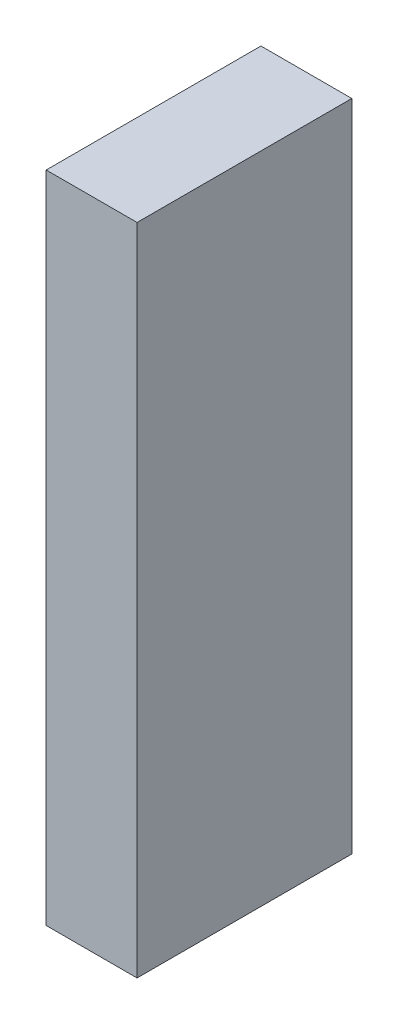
ISO-10303-21;
HEADER;
FILE_DESCRIPTION(('STEP AP214'),'2;1');
FILE_NAME('part.step','',(''),(''),'','','');
FILE_SCHEMA(('AUTOMOTIVE_DESIGN { 1 0 10303 214 1 1 1 1 }'));
ENDSEC;
DATA;
#1=APPLICATION_CONTEXT('core data for automotive mechanical design processes');
#2=APPLICATION_PROTOCOL_DEFINITION('international standard','automotive_design',2000,#1);
#3=PRODUCT_CONTEXT('',#1,'mechanical');
#4=PRODUCT('Part','Part','',(#3));
#5=PRODUCT_RELATED_PRODUCT_CATEGORY('part','',(#4));
#6=PRODUCT_DEFINITION_FORMATION('','',#4);
#7=PRODUCT_DEFINITION_CONTEXT('part definition',#1,'design');
#8=PRODUCT_DEFINITION('design','',#6,#7);
#9=PRODUCT_DEFINITION_SHAPE('','',#8);
#10=(LENGTH_UNIT() NAMED_UNIT(*) SI_UNIT(.MILLI.,.METRE.));
#11=(NAMED_UNIT(*) PLANE_ANGLE_UNIT() SI_UNIT($,.RADIAN.));
#12=(NAMED_UNIT(*) SI_UNIT($,.STERADIAN.) SOLID_ANGLE_UNIT());
#13=UNCERTAINTY_MEASURE_WITH_UNIT(LENGTH_MEASURE(1.E-05),#10,'distance_accuracy_value','');
#14=(GEOMETRIC_REPRESENTATION_CONTEXT(3) GLOBAL_UNCERTAINTY_ASSIGNED_CONTEXT((#13)) GLOBAL_UNIT_ASSIGNED_CONTEXT((#10,
#11,#12)) REPRESENTATION_CONTEXT('',''));
#15=CARTESIAN_POINT('',(0.,0.,0.));
#16=DIRECTION('',(0.,0.,1.));
#17=DIRECTION('',(1.,0.,0.));
#18=AXIS2_PLACEMENT_3D('',#15,#16,#17);
#19=CARTESIAN_POINT('',(127.,1828.8,-300.1));
#20=DIRECTION('',(-1.,0.,0.));
#21=DIRECTION('',(0.,0.,1.));
#22=AXIS2_PLACEMENT_3D('',#19,#20,#21);
#23=PLANE('',#22);
#24=DIRECTION('',(0.,0.,-1.));
#25=VECTOR('',#24,1.);
#26=CARTESIAN_POINT('',(127.,0.,-300.1));
#27=LINE('',#26,#25);
#28=CARTESIAN_POINT('',(127.,0.,300.1));
#29=VERTEX_POINT('',#28);
#30=CARTESIAN_POINT('',(127.,0.,-300.1));
#31=VERTEX_POINT('',#30);
#32=EDGE_CURVE('E96',#29,#31,#27,.T.);
#33=ORIENTED_EDGE('',*,*,#32,.T.);
#34=DIRECTION('',(0.,-1.,0.));
#35=VECTOR('',#34,1.);
#36=CARTESIAN_POINT('',(127.,1828.8,-300.1));
#37=LINE('',#36,#35);
#38=CARTESIAN_POINT('',(127.,1828.8,-300.1));
#39=VERTEX_POINT('',#38);
#40=EDGE_CURVE('E11',#39,#31,#37,.T.);
#41=ORIENTED_EDGE('',*,*,#40,.F.);
#42=DIRECTION('',(0.,0.,-1.));
#43=VECTOR('',#42,1.);
#44=CARTESIAN_POINT('',(127.,1828.8,-300.1));
#45=LINE('',#44,#43);
#46=CARTESIAN_POINT('',(127.,1828.8,300.1));
#47=VERTEX_POINT('',#46);
#48=EDGE_CURVE('E84',#47,#39,#45,.T.);
#49=ORIENTED_EDGE('',*,*,#48,.F.);
#50=DIRECTION('',(0.,-1.,0.));
#51=VECTOR('',#50,1.);
#52=CARTESIAN_POINT('',(127.,1828.8,300.1));
#53=LINE('',#52,#51);
#54=EDGE_CURVE('E92',#47,#29,#53,.T.);
#55=ORIENTED_EDGE('',*,*,#54,.T.);
#56=EDGE_LOOP('',(#33,#41,#49,#55));
#57=FACE_BOUND('',#56,.T.);
#58=ADVANCED_FACE('F33',(#57),#23,.F.);
#59=CARTESIAN_POINT('',(-127.,1828.8,-300.1));
#60=DIRECTION('',(0.,0.,1.));
#61=DIRECTION('',(1.,0.,0.));
#62=AXIS2_PLACEMENT_3D('',#59,#60,#61);
#63=PLANE('',#62);
#64=DIRECTION('',(-1.,0.,0.));
#65=VECTOR('',#64,1.);
#66=CARTESIAN_POINT('',(-127.,0.,-300.1));
#67=LINE('',#66,#65);
#68=CARTESIAN_POINT('',(-127.,0.,-300.1));
#69=VERTEX_POINT('',#68);
#70=EDGE_CURVE('E88',#31,#69,#67,.T.);
#71=ORIENTED_EDGE('',*,*,#70,.T.);
#72=DIRECTION('',(0.,-1.,0.));
#73=VECTOR('',#72,1.);
#74=CARTESIAN_POINT('',(-127.,1828.8,-300.1));
#75=LINE('',#74,#73);
#76=CARTESIAN_POINT('',(-127.,1828.8,-300.1));
#77=VERTEX_POINT('',#76);
#78=EDGE_CURVE('E41',#77,#69,#75,.T.);
#79=ORIENTED_EDGE('',*,*,#78,.F.);
#80=DIRECTION('',(-1.,0.,0.));
#81=VECTOR('',#80,1.);
#82=CARTESIAN_POINT('',(-127.,1828.8,-300.1));
#83=LINE('',#82,#81);
#84=EDGE_CURVE('E79',#39,#77,#83,.T.);
#85=ORIENTED_EDGE('',*,*,#84,.F.);
#86=ORIENTED_EDGE('',*,*,#40,.T.);
#87=EDGE_LOOP('',(#71,#79,#85,#86));
#88=FACE_BOUND('',#87,.T.);
#89=ADVANCED_FACE('F87',(#88),#63,.F.);
#90=CARTESIAN_POINT('',(-127.,1828.8,-300.1));
#91=DIRECTION('',(1.,0.,0.));
#92=DIRECTION('',(0.,0.,-1.));
#93=AXIS2_PLACEMENT_3D('',#90,#91,#92);
#94=PLANE('',#93);
#95=DIRECTION('',(0.,0.,1.));
#96=VECTOR('',#95,1.);
#97=CARTESIAN_POINT('',(-127.,0.,-300.1));
#98=LINE('',#97,#96);
#99=CARTESIAN_POINT('',(-127.,0.,300.1));
#100=VERTEX_POINT('',#99);
#101=EDGE_CURVE('E66',#69,#100,#98,.T.);
#102=ORIENTED_EDGE('',*,*,#101,.T.);
#103=DIRECTION('',(0.,-1.,0.));
#104=VECTOR('',#103,1.);
#105=CARTESIAN_POINT('',(-127.,1828.8,300.1));
#106=LINE('',#105,#104);
#107=CARTESIAN_POINT('',(-127.,1828.8,300.1));
#108=VERTEX_POINT('',#107);
#109=EDGE_CURVE('E89',#108,#100,#106,.T.);
#110=ORIENTED_EDGE('',*,*,#109,.F.);
#111=DIRECTION('',(0.,0.,1.));
#112=VECTOR('',#111,1.);
#113=CARTESIAN_POINT('',(-127.,1828.8,-300.1));
#114=LINE('',#113,#112);
#115=EDGE_CURVE('E82',#77,#108,#114,.T.);
#116=ORIENTED_EDGE('',*,*,#115,.F.);
#117=ORIENTED_EDGE('',*,*,#78,.T.);
#118=EDGE_LOOP('',(#102,#110,#116,#117));
#119=FACE_BOUND('',#118,.T.);
#120=ADVANCED_FACE('F90',(#119),#94,.F.);
#121=CARTESIAN_POINT('',(-127.,1828.8,300.1));
#122=DIRECTION('',(0.,0.,-1.));
#123=DIRECTION('',(-1.,0.,0.));
#124=AXIS2_PLACEMENT_3D('',#121,#122,#123);
#125=PLANE('',#124);
#126=DIRECTION('',(1.,0.,0.));
#127=VECTOR('',#126,1.);
#128=CARTESIAN_POINT('',(-127.,0.,300.1));
#129=LINE('',#128,#127);
#130=EDGE_CURVE('E72',#100,#29,#129,.T.);
#131=ORIENTED_EDGE('',*,*,#130,.T.);
#132=ORIENTED_EDGE('',*,*,#54,.F.);
#133=DIRECTION('',(1.,0.,0.));
#134=VECTOR('',#133,1.);
#135=CARTESIAN_POINT('',(-127.,1828.8,300.1));
#136=LINE('',#135,#134);
#137=EDGE_CURVE('E49',#108,#47,#136,.T.);
#138=ORIENTED_EDGE('',*,*,#137,.F.);
#139=ORIENTED_EDGE('',*,*,#109,.T.);
#140=EDGE_LOOP('',(#131,#132,#138,#139));
#141=FACE_BOUND('',#140,.T.);
#142=ADVANCED_FACE('F103',(#141),#125,.F.);
#143=CARTESIAN_POINT('',(0.,1828.8,0.));
#144=DIRECTION('',(0.,1.,0.));
#145=DIRECTION('',(0.,0.,1.));
#146=AXIS2_PLACEMENT_3D('',#143,#144,#145);
#147=PLANE('',#146);
#148=ORIENTED_EDGE('',*,*,#48,.T.);
#149=ORIENTED_EDGE('',*,*,#84,.T.);
#150=ORIENTED_EDGE('',*,*,#115,.T.);
#151=ORIENTED_EDGE('',*,*,#137,.T.);
#152=EDGE_LOOP('',(#148,#149,#150,#151));
#153=FACE_BOUND('',#152,.T.);
#154=ADVANCED_FACE('F80',(#153),#147,.T.);
#155=CARTESIAN_POINT('',(0.,0.,0.));
#156=DIRECTION('',(0.,1.,0.));
#157=DIRECTION('',(0.,0.,1.));
#158=AXIS2_PLACEMENT_3D('',#155,#156,#157);
#159=PLANE('',#158);
#160=ORIENTED_EDGE('',*,*,#32,.F.);
#161=ORIENTED_EDGE('',*,*,#130,.F.);
#162=ORIENTED_EDGE('',*,*,#101,.F.);
#163=ORIENTED_EDGE('',*,*,#70,.F.);
#164=EDGE_LOOP('',(#160,#161,#162,#163));
#165=FACE_BOUND('',#164,.T.);
#166=ADVANCED_FACE('F106',(#165),#159,.F.);
#167=CLOSED_SHELL('',(#58,#89,#120,#142,#154,#166));
#168=MANIFOLD_SOLID_BREP('B2',#167);
#169=ADVANCED_BREP_SHAPE_REPRESENTATION('',(#18,#168),#14);
#170=SHAPE_DEFINITION_REPRESENTATION(#9,#169);
ENDSEC;
END-ISO-10303-21;
